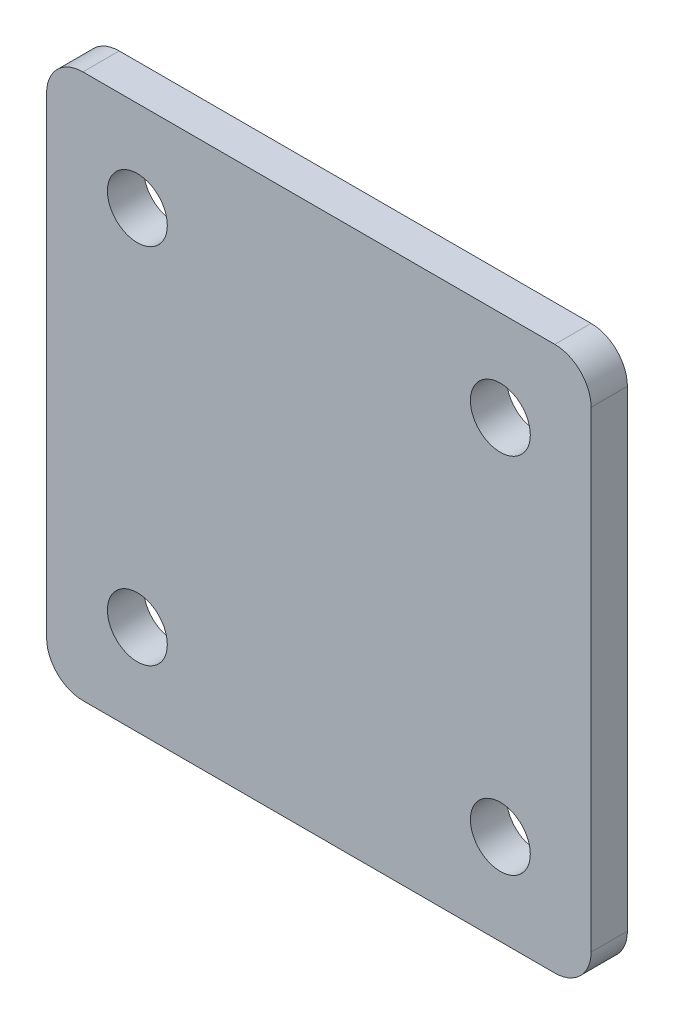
ISO-10303-21;
HEADER;
FILE_DESCRIPTION(('STEP AP214'),'2;1');
FILE_NAME('part.step','',(''),(''),'','','');
FILE_SCHEMA(('AUTOMOTIVE_DESIGN { 1 0 10303 214 1 1 1 1 }'));
ENDSEC;
DATA;
#1=APPLICATION_CONTEXT('core data for automotive mechanical design processes');
#2=APPLICATION_PROTOCOL_DEFINITION('international standard','automotive_design',2000,#1);
#3=PRODUCT_CONTEXT('',#1,'mechanical');
#4=PRODUCT('Part','Part','',(#3));
#5=PRODUCT_RELATED_PRODUCT_CATEGORY('part','',(#4));
#6=PRODUCT_DEFINITION_FORMATION('','',#4);
#7=PRODUCT_DEFINITION_CONTEXT('part definition',#1,'design');
#8=PRODUCT_DEFINITION('design','',#6,#7);
#9=PRODUCT_DEFINITION_SHAPE('','',#8);
#10=(LENGTH_UNIT() NAMED_UNIT(*) SI_UNIT(.MILLI.,.METRE.));
#11=(NAMED_UNIT(*) PLANE_ANGLE_UNIT() SI_UNIT($,.RADIAN.));
#12=(NAMED_UNIT(*) SI_UNIT($,.STERADIAN.) SOLID_ANGLE_UNIT());
#13=UNCERTAINTY_MEASURE_WITH_UNIT(LENGTH_MEASURE(1.E-05),#10,'distance_accuracy_value','');
#14=(GEOMETRIC_REPRESENTATION_CONTEXT(3) GLOBAL_UNCERTAINTY_ASSIGNED_CONTEXT((#13)) GLOBAL_UNIT_ASSIGNED_CONTEXT((#10,
#11,#12)) REPRESENTATION_CONTEXT('',''));
#15=CARTESIAN_POINT('',(0.,0.,0.));
#16=DIRECTION('',(0.,0.,1.));
#17=DIRECTION('',(1.,0.,0.));
#18=AXIS2_PLACEMENT_3D('',#15,#16,#17);
#19=CARTESIAN_POINT('',(15.,15.,2.));
#20=DIRECTION('',(-1.,0.,0.));
#21=DIRECTION('',(0.,-1.,0.));
#22=AXIS2_PLACEMENT_3D('',#19,#20,#21);
#23=PLANE('',#22);
#24=DIRECTION('',(0.,1.,0.));
#25=VECTOR('',#24,1.);
#26=CARTESIAN_POINT('',(15.,15.,2.));
#27=LINE('',#26,#25);
#28=CARTESIAN_POINT('',(15.,-13.,2.));
#29=VERTEX_POINT('',#28);
#30=CARTESIAN_POINT('',(15.,13.,2.));
#31=VERTEX_POINT('',#30);
#32=EDGE_CURVE('E133',#29,#31,#27,.T.);
#33=ORIENTED_EDGE('',*,*,#32,.F.);
#34=DIRECTION('',(0.,0.,-1.));
#35=VECTOR('',#34,1.);
#36=CARTESIAN_POINT('',(15.,-13.,2.));
#37=LINE('',#36,#35);
#38=CARTESIAN_POINT('',(15.,-13.,0.));
#39=VERTEX_POINT('',#38);
#40=EDGE_CURVE('E159',#29,#39,#37,.T.);
#41=ORIENTED_EDGE('',*,*,#40,.T.);
#42=DIRECTION('',(0.,1.,0.));
#43=VECTOR('',#42,1.);
#44=CARTESIAN_POINT('',(15.,15.,0.));
#45=LINE('',#44,#43);
#46=CARTESIAN_POINT('',(15.,13.,0.));
#47=VERTEX_POINT('',#46);
#48=EDGE_CURVE('E165',#39,#47,#45,.T.);
#49=ORIENTED_EDGE('',*,*,#48,.T.);
#50=DIRECTION('',(0.,0.,-1.));
#51=VECTOR('',#50,1.);
#52=CARTESIAN_POINT('',(15.,13.,2.));
#53=LINE('',#52,#51);
#54=EDGE_CURVE('E157',#47,#31,#53,.F.);
#55=ORIENTED_EDGE('',*,*,#54,.T.);
#56=EDGE_LOOP('',(#33,#41,#49,#55));
#57=FACE_BOUND('',#56,.T.);
#58=ADVANCED_FACE('F41',(#57),#23,.F.);
#59=CARTESIAN_POINT('',(-15.,15.,2.));
#60=DIRECTION('',(0.,-1.,0.));
#61=DIRECTION('',(0.,0.,-1.));
#62=AXIS2_PLACEMENT_3D('',#59,#60,#61);
#63=PLANE('',#62);
#64=DIRECTION('',(-1.,0.,0.));
#65=VECTOR('',#64,1.);
#66=CARTESIAN_POINT('',(-15.,15.,2.));
#67=LINE('',#66,#65);
#68=CARTESIAN_POINT('',(13.,15.,2.));
#69=VERTEX_POINT('',#68);
#70=CARTESIAN_POINT('',(-13.,15.,2.));
#71=VERTEX_POINT('',#70);
#72=EDGE_CURVE('E136',#69,#71,#67,.T.);
#73=ORIENTED_EDGE('',*,*,#72,.F.);
#74=DIRECTION('',(0.,0.,-1.));
#75=VECTOR('',#74,1.);
#76=CARTESIAN_POINT('',(13.,15.,2.));
#77=LINE('',#76,#75);
#78=CARTESIAN_POINT('',(13.,15.,0.));
#79=VERTEX_POINT('',#78);
#80=EDGE_CURVE('E11',#69,#79,#77,.T.);
#81=ORIENTED_EDGE('',*,*,#80,.T.);
#82=DIRECTION('',(-1.,0.,0.));
#83=VECTOR('',#82,1.);
#84=CARTESIAN_POINT('',(-15.,15.,0.));
#85=LINE('',#84,#83);
#86=CARTESIAN_POINT('',(-13.,15.,0.));
#87=VERTEX_POINT('',#86);
#88=EDGE_CURVE('E138',#79,#87,#85,.T.);
#89=ORIENTED_EDGE('',*,*,#88,.T.);
#90=DIRECTION('',(0.,0.,-1.));
#91=VECTOR('',#90,1.);
#92=CARTESIAN_POINT('',(-13.,15.,2.));
#93=LINE('',#92,#91);
#94=EDGE_CURVE('E49',#87,#71,#93,.F.);
#95=ORIENTED_EDGE('',*,*,#94,.T.);
#96=EDGE_LOOP('',(#73,#81,#89,#95));
#97=FACE_BOUND('',#96,.T.);
#98=ADVANCED_FACE('F219',(#97),#63,.F.);
#99=CARTESIAN_POINT('',(-15.,15.,2.));
#100=DIRECTION('',(1.,0.,0.));
#101=DIRECTION('',(0.,1.,0.));
#102=AXIS2_PLACEMENT_3D('',#99,#100,#101);
#103=PLANE('',#102);
#104=DIRECTION('',(0.,-1.,0.));
#105=VECTOR('',#104,1.);
#106=CARTESIAN_POINT('',(-15.,15.,0.));
#107=LINE('',#106,#105);
#108=CARTESIAN_POINT('',(-15.,13.,0.));
#109=VERTEX_POINT('',#108);
#110=CARTESIAN_POINT('',(-15.,-13.,0.));
#111=VERTEX_POINT('',#110);
#112=EDGE_CURVE('E134',#109,#111,#107,.T.);
#113=ORIENTED_EDGE('',*,*,#112,.T.);
#114=DIRECTION('',(0.,0.,-1.));
#115=VECTOR('',#114,1.);
#116=CARTESIAN_POINT('',(-15.,-13.,2.));
#117=LINE('',#116,#115);
#118=CARTESIAN_POINT('',(-15.,-13.,2.));
#119=VERTEX_POINT('',#118);
#120=EDGE_CURVE('E112',#111,#119,#117,.F.);
#121=ORIENTED_EDGE('',*,*,#120,.T.);
#122=DIRECTION('',(0.,-1.,0.));
#123=VECTOR('',#122,1.);
#124=CARTESIAN_POINT('',(-15.,15.,2.));
#125=LINE('',#124,#123);
#126=CARTESIAN_POINT('',(-15.,13.,2.));
#127=VERTEX_POINT('',#126);
#128=EDGE_CURVE('E177',#127,#119,#125,.T.);
#129=ORIENTED_EDGE('',*,*,#128,.F.);
#130=DIRECTION('',(0.,0.,-1.));
#131=VECTOR('',#130,1.);
#132=CARTESIAN_POINT('',(-15.,13.,2.));
#133=LINE('',#132,#131);
#134=EDGE_CURVE('E117',#127,#109,#133,.T.);
#135=ORIENTED_EDGE('',*,*,#134,.T.);
#136=EDGE_LOOP('',(#113,#121,#129,#135));
#137=FACE_BOUND('',#136,.T.);
#138=ADVANCED_FACE('F217',(#137),#103,.F.);
#139=CARTESIAN_POINT('',(-15.,-15.,2.));
#140=DIRECTION('',(0.,1.,0.));
#141=DIRECTION('',(0.,0.,1.));
#142=AXIS2_PLACEMENT_3D('',#139,#140,#141);
#143=PLANE('',#142);
#144=DIRECTION('',(1.,0.,0.));
#145=VECTOR('',#144,1.);
#146=CARTESIAN_POINT('',(-15.,-15.,2.));
#147=LINE('',#146,#145);
#148=CARTESIAN_POINT('',(-13.,-15.,2.));
#149=VERTEX_POINT('',#148);
#150=CARTESIAN_POINT('',(13.,-15.,2.));
#151=VERTEX_POINT('',#150);
#152=EDGE_CURVE('E127',#149,#151,#147,.T.);
#153=ORIENTED_EDGE('',*,*,#152,.F.);
#154=DIRECTION('',(0.,0.,-1.));
#155=VECTOR('',#154,1.);
#156=CARTESIAN_POINT('',(-13.,-15.,2.));
#157=LINE('',#156,#155);
#158=CARTESIAN_POINT('',(-13.,-15.,0.));
#159=VERTEX_POINT('',#158);
#160=EDGE_CURVE('E111',#149,#159,#157,.T.);
#161=ORIENTED_EDGE('',*,*,#160,.T.);
#162=DIRECTION('',(1.,0.,0.));
#163=VECTOR('',#162,1.);
#164=CARTESIAN_POINT('',(-15.,-15.,0.));
#165=LINE('',#164,#163);
#166=CARTESIAN_POINT('',(13.,-15.,0.));
#167=VERTEX_POINT('',#166);
#168=EDGE_CURVE('E124',#159,#167,#165,.T.);
#169=ORIENTED_EDGE('',*,*,#168,.T.);
#170=DIRECTION('',(0.,0.,-1.));
#171=VECTOR('',#170,1.);
#172=CARTESIAN_POINT('',(13.,-15.,2.));
#173=LINE('',#172,#171);
#174=EDGE_CURVE('E129',#167,#151,#173,.F.);
#175=ORIENTED_EDGE('',*,*,#174,.T.);
#176=EDGE_LOOP('',(#153,#161,#169,#175));
#177=FACE_BOUND('',#176,.T.);
#178=ADVANCED_FACE('F123',(#177),#143,.F.);
#179=CARTESIAN_POINT('',(0.,0.,2.));
#180=DIRECTION('',(0.,0.,1.));
#181=DIRECTION('',(1.,0.,0.));
#182=AXIS2_PLACEMENT_3D('',#179,#180,#181);
#183=PLANE('',#182);
#184=CARTESIAN_POINT('',(-10.,10.,2.));
#185=DIRECTION('',(0.,0.,1.));
#186=DIRECTION('',(1.,0.,0.));
#187=AXIS2_PLACEMENT_3D('',#184,#185,#186);
#188=CIRCLE('',#187,1.65);
#189=CARTESIAN_POINT('',(-8.35,10.,2.));
#190=VERTEX_POINT('',#189);
#191=EDGE_CURVE('E198',#190,#190,#188,.T.);
#192=ORIENTED_EDGE('',*,*,#191,.F.);
#193=EDGE_LOOP('',(#192));
#194=FACE_BOUND('',#193,.T.);
#195=CARTESIAN_POINT('',(10.,10.,2.));
#196=DIRECTION('',(0.,0.,1.));
#197=DIRECTION('',(1.,0.,0.));
#198=AXIS2_PLACEMENT_3D('',#195,#196,#197);
#199=CIRCLE('',#198,1.65);
#200=CARTESIAN_POINT('',(11.65,10.,2.));
#201=VERTEX_POINT('',#200);
#202=EDGE_CURVE('E192',#201,#201,#199,.T.);
#203=ORIENTED_EDGE('',*,*,#202,.F.);
#204=EDGE_LOOP('',(#203));
#205=FACE_BOUND('',#204,.T.);
#206=CARTESIAN_POINT('',(-10.,-10.,2.));
#207=DIRECTION('',(0.,0.,1.));
#208=DIRECTION('',(1.,0.,0.));
#209=AXIS2_PLACEMENT_3D('',#206,#207,#208);
#210=CIRCLE('',#209,1.65);
#211=CARTESIAN_POINT('',(-8.35,-10.,2.));
#212=VERTEX_POINT('',#211);
#213=EDGE_CURVE('E186',#212,#212,#210,.T.);
#214=ORIENTED_EDGE('',*,*,#213,.F.);
#215=EDGE_LOOP('',(#214));
#216=FACE_BOUND('',#215,.T.);
#217=CARTESIAN_POINT('',(10.,-10.,2.));
#218=DIRECTION('',(0.,0.,1.));
#219=DIRECTION('',(1.,0.,0.));
#220=AXIS2_PLACEMENT_3D('',#217,#218,#219);
#221=CIRCLE('',#220,1.65);
#222=CARTESIAN_POINT('',(11.65,-10.,2.));
#223=VERTEX_POINT('',#222);
#224=EDGE_CURVE('E173',#223,#223,#221,.T.);
#225=ORIENTED_EDGE('',*,*,#224,.F.);
#226=EDGE_LOOP('',(#225));
#227=FACE_BOUND('',#226,.T.);
#228=ORIENTED_EDGE('',*,*,#128,.T.);
#229=CARTESIAN_POINT('',(-13.,-13.,2.));
#230=DIRECTION('',(0.,0.,1.));
#231=DIRECTION('',(1.,0.,0.));
#232=AXIS2_PLACEMENT_3D('',#229,#230,#231);
#233=CIRCLE('',#232,2.);
#234=EDGE_CURVE('E155',#119,#149,#233,.T.);
#235=ORIENTED_EDGE('',*,*,#234,.T.);
#236=ORIENTED_EDGE('',*,*,#152,.T.);
#237=CARTESIAN_POINT('',(13.,-13.,2.));
#238=DIRECTION('',(0.,0.,1.));
#239=DIRECTION('',(1.,0.,0.));
#240=AXIS2_PLACEMENT_3D('',#237,#238,#239);
#241=CIRCLE('',#240,2.);
#242=EDGE_CURVE('E153',#151,#29,#241,.T.);
#243=ORIENTED_EDGE('',*,*,#242,.T.);
#244=ORIENTED_EDGE('',*,*,#32,.T.);
#245=CARTESIAN_POINT('',(13.,13.,2.));
#246=DIRECTION('',(0.,0.,1.));
#247=DIRECTION('',(1.,0.,0.));
#248=AXIS2_PLACEMENT_3D('',#245,#246,#247);
#249=CIRCLE('',#248,2.);
#250=EDGE_CURVE('E62',#31,#69,#249,.T.);
#251=ORIENTED_EDGE('',*,*,#250,.T.);
#252=ORIENTED_EDGE('',*,*,#72,.T.);
#253=CARTESIAN_POINT('',(-13.,13.,2.));
#254=DIRECTION('',(0.,0.,1.));
#255=DIRECTION('',(1.,0.,0.));
#256=AXIS2_PLACEMENT_3D('',#253,#254,#255);
#257=CIRCLE('',#256,2.);
#258=EDGE_CURVE('E150',#71,#127,#257,.T.);
#259=ORIENTED_EDGE('',*,*,#258,.T.);
#260=EDGE_LOOP('',(#228,#235,#236,#243,#244,#251,#252,#259));
#261=FACE_BOUND('',#260,.T.);
#262=ADVANCED_FACE('F204',(#194,#205,#216,#227,#261),#183,.T.);
#263=CARTESIAN_POINT('',(0.,0.,0.));
#264=DIRECTION('',(0.,0.,1.));
#265=DIRECTION('',(1.,0.,0.));
#266=AXIS2_PLACEMENT_3D('',#263,#264,#265);
#267=PLANE('',#266);
#268=CARTESIAN_POINT('',(-10.,10.,0.));
#269=DIRECTION('',(0.,0.,1.));
#270=DIRECTION('',(1.,0.,0.));
#271=AXIS2_PLACEMENT_3D('',#268,#269,#270);
#272=CIRCLE('',#271,1.65);
#273=CARTESIAN_POINT('',(-8.35,10.,0.));
#274=VERTEX_POINT('',#273);
#275=EDGE_CURVE('E195',#274,#274,#272,.T.);
#276=ORIENTED_EDGE('',*,*,#275,.T.);
#277=EDGE_LOOP('',(#276));
#278=FACE_BOUND('',#277,.T.);
#279=CARTESIAN_POINT('',(10.,10.,0.));
#280=DIRECTION('',(0.,0.,1.));
#281=DIRECTION('',(1.,0.,0.));
#282=AXIS2_PLACEMENT_3D('',#279,#280,#281);
#283=CIRCLE('',#282,1.65);
#284=CARTESIAN_POINT('',(11.65,10.,0.));
#285=VERTEX_POINT('',#284);
#286=EDGE_CURVE('E189',#285,#285,#283,.T.);
#287=ORIENTED_EDGE('',*,*,#286,.T.);
#288=EDGE_LOOP('',(#287));
#289=FACE_BOUND('',#288,.T.);
#290=CARTESIAN_POINT('',(-10.,-10.,0.));
#291=DIRECTION('',(0.,0.,1.));
#292=DIRECTION('',(1.,0.,0.));
#293=AXIS2_PLACEMENT_3D('',#290,#291,#292);
#294=CIRCLE('',#293,1.65);
#295=CARTESIAN_POINT('',(-8.35,-10.,0.));
#296=VERTEX_POINT('',#295);
#297=EDGE_CURVE('E183',#296,#296,#294,.T.);
#298=ORIENTED_EDGE('',*,*,#297,.T.);
#299=EDGE_LOOP('',(#298));
#300=FACE_BOUND('',#299,.T.);
#301=CARTESIAN_POINT('',(10.,-10.,0.));
#302=DIRECTION('',(0.,0.,1.));
#303=DIRECTION('',(1.,0.,0.));
#304=AXIS2_PLACEMENT_3D('',#301,#302,#303);
#305=CIRCLE('',#304,1.65);
#306=CARTESIAN_POINT('',(11.65,-10.,0.));
#307=VERTEX_POINT('',#306);
#308=EDGE_CURVE('E170',#307,#307,#305,.T.);
#309=ORIENTED_EDGE('',*,*,#308,.T.);
#310=EDGE_LOOP('',(#309));
#311=FACE_BOUND('',#310,.T.);
#312=ORIENTED_EDGE('',*,*,#168,.F.);
#313=CARTESIAN_POINT('',(-13.,-13.,0.));
#314=DIRECTION('',(0.,0.,1.));
#315=DIRECTION('',(1.,0.,0.));
#316=AXIS2_PLACEMENT_3D('',#313,#314,#315);
#317=CIRCLE('',#316,2.);
#318=EDGE_CURVE('E107',#159,#111,#317,.F.);
#319=ORIENTED_EDGE('',*,*,#318,.T.);
#320=ORIENTED_EDGE('',*,*,#112,.F.);
#321=CARTESIAN_POINT('',(-13.,13.,0.));
#322=DIRECTION('',(0.,0.,1.));
#323=DIRECTION('',(1.,0.,0.));
#324=AXIS2_PLACEMENT_3D('',#321,#322,#323);
#325=CIRCLE('',#324,2.);
#326=EDGE_CURVE('E128',#109,#87,#325,.F.);
#327=ORIENTED_EDGE('',*,*,#326,.T.);
#328=ORIENTED_EDGE('',*,*,#88,.F.);
#329=CARTESIAN_POINT('',(13.,13.,0.));
#330=DIRECTION('',(0.,0.,1.));
#331=DIRECTION('',(1.,0.,0.));
#332=AXIS2_PLACEMENT_3D('',#329,#330,#331);
#333=CIRCLE('',#332,2.);
#334=EDGE_CURVE('E144',#79,#47,#333,.F.);
#335=ORIENTED_EDGE('',*,*,#334,.T.);
#336=ORIENTED_EDGE('',*,*,#48,.F.);
#337=CARTESIAN_POINT('',(13.,-13.,0.));
#338=DIRECTION('',(0.,0.,1.));
#339=DIRECTION('',(1.,0.,0.));
#340=AXIS2_PLACEMENT_3D('',#337,#338,#339);
#341=CIRCLE('',#340,2.);
#342=EDGE_CURVE('E118',#39,#167,#341,.F.);
#343=ORIENTED_EDGE('',*,*,#342,.T.);
#344=EDGE_LOOP('',(#312,#319,#320,#327,#328,#335,#336,#343));
#345=FACE_BOUND('',#344,.T.);
#346=ADVANCED_FACE('F131',(#278,#289,#300,#311,#345),#267,.F.);
#347=CARTESIAN_POINT('',(10.,-10.,2.));
#348=DIRECTION('',(0.,0.,1.));
#349=DIRECTION('',(1.,0.,0.));
#350=AXIS2_PLACEMENT_3D('',#347,#348,#349);
#351=CYLINDRICAL_SURFACE('',#350,1.65);
#352=ORIENTED_EDGE('',*,*,#308,.F.);
#353=EDGE_LOOP('',(#352));
#354=FACE_BOUND('',#353,.T.);
#355=ORIENTED_EDGE('',*,*,#224,.T.);
#356=EDGE_LOOP('',(#355));
#357=FACE_BOUND('',#356,.T.);
#358=ADVANCED_FACE('F243',(#354,#357),#351,.F.);
#359=CARTESIAN_POINT('',(-10.,-10.,2.));
#360=DIRECTION('',(0.,0.,1.));
#361=DIRECTION('',(1.,0.,0.));
#362=AXIS2_PLACEMENT_3D('',#359,#360,#361);
#363=CYLINDRICAL_SURFACE('',#362,1.65);
#364=ORIENTED_EDGE('',*,*,#297,.F.);
#365=EDGE_LOOP('',(#364));
#366=FACE_BOUND('',#365,.T.);
#367=ORIENTED_EDGE('',*,*,#213,.T.);
#368=EDGE_LOOP('',(#367));
#369=FACE_BOUND('',#368,.T.);
#370=ADVANCED_FACE('F248',(#366,#369),#363,.F.);
#371=CARTESIAN_POINT('',(10.,10.,2.));
#372=DIRECTION('',(0.,0.,1.));
#373=DIRECTION('',(1.,0.,0.));
#374=AXIS2_PLACEMENT_3D('',#371,#372,#373);
#375=CYLINDRICAL_SURFACE('',#374,1.65);
#376=ORIENTED_EDGE('',*,*,#286,.F.);
#377=EDGE_LOOP('',(#376));
#378=FACE_BOUND('',#377,.T.);
#379=ORIENTED_EDGE('',*,*,#202,.T.);
#380=EDGE_LOOP('',(#379));
#381=FACE_BOUND('',#380,.T.);
#382=ADVANCED_FACE('F252',(#378,#381),#375,.F.);
#383=CARTESIAN_POINT('',(-10.,10.,2.));
#384=DIRECTION('',(0.,0.,1.));
#385=DIRECTION('',(1.,0.,0.));
#386=AXIS2_PLACEMENT_3D('',#383,#384,#385);
#387=CYLINDRICAL_SURFACE('',#386,1.65);
#388=ORIENTED_EDGE('',*,*,#275,.F.);
#389=EDGE_LOOP('',(#388));
#390=FACE_BOUND('',#389,.T.);
#391=ORIENTED_EDGE('',*,*,#191,.T.);
#392=EDGE_LOOP('',(#391));
#393=FACE_BOUND('',#392,.T.);
#394=ADVANCED_FACE('F202',(#390,#393),#387,.F.);
#395=CARTESIAN_POINT('',(-13.,-13.,2.));
#396=DIRECTION('',(0.,0.,-1.));
#397=DIRECTION('',(-1.,0.,0.));
#398=AXIS2_PLACEMENT_3D('',#395,#396,#397);
#399=CYLINDRICAL_SURFACE('',#398,2.);
#400=ORIENTED_EDGE('',*,*,#234,.F.);
#401=ORIENTED_EDGE('',*,*,#120,.F.);
#402=ORIENTED_EDGE('',*,*,#318,.F.);
#403=ORIENTED_EDGE('',*,*,#160,.F.);
#404=EDGE_LOOP('',(#400,#401,#402,#403));
#405=FACE_BOUND('',#404,.T.);
#406=ADVANCED_FACE('F110',(#405),#399,.T.);
#407=CARTESIAN_POINT('',(13.,-13.,2.));
#408=DIRECTION('',(0.,0.,-1.));
#409=DIRECTION('',(-1.,0.,0.));
#410=AXIS2_PLACEMENT_3D('',#407,#408,#409);
#411=CYLINDRICAL_SURFACE('',#410,2.);
#412=ORIENTED_EDGE('',*,*,#242,.F.);
#413=ORIENTED_EDGE('',*,*,#174,.F.);
#414=ORIENTED_EDGE('',*,*,#342,.F.);
#415=ORIENTED_EDGE('',*,*,#40,.F.);
#416=EDGE_LOOP('',(#412,#413,#414,#415));
#417=FACE_BOUND('',#416,.T.);
#418=ADVANCED_FACE('F223',(#417),#411,.T.);
#419=CARTESIAN_POINT('',(13.,13.,2.));
#420=DIRECTION('',(0.,0.,-1.));
#421=DIRECTION('',(-1.,0.,0.));
#422=AXIS2_PLACEMENT_3D('',#419,#420,#421);
#423=CYLINDRICAL_SURFACE('',#422,2.);
#424=ORIENTED_EDGE('',*,*,#250,.F.);
#425=ORIENTED_EDGE('',*,*,#54,.F.);
#426=ORIENTED_EDGE('',*,*,#334,.F.);
#427=ORIENTED_EDGE('',*,*,#80,.F.);
#428=EDGE_LOOP('',(#424,#425,#426,#427));
#429=FACE_BOUND('',#428,.T.);
#430=ADVANCED_FACE('F222',(#429),#423,.T.);
#431=CARTESIAN_POINT('',(-13.,13.,2.));
#432=DIRECTION('',(0.,0.,-1.));
#433=DIRECTION('',(-1.,0.,0.));
#434=AXIS2_PLACEMENT_3D('',#431,#432,#433);
#435=CYLINDRICAL_SURFACE('',#434,2.);
#436=ORIENTED_EDGE('',*,*,#258,.F.);
#437=ORIENTED_EDGE('',*,*,#94,.F.);
#438=ORIENTED_EDGE('',*,*,#326,.F.);
#439=ORIENTED_EDGE('',*,*,#134,.F.);
#440=EDGE_LOOP('',(#436,#437,#438,#439));
#441=FACE_BOUND('',#440,.T.);
#442=ADVANCED_FACE('F43',(#441),#435,.T.);
#443=CLOSED_SHELL('',(#58,#98,#138,#178,#262,#346,#358,#370,#382,#394,#406,#418,#430,#442));
#444=MANIFOLD_SOLID_BREP('B2',#443);
#445=ADVANCED_BREP_SHAPE_REPRESENTATION('',(#18,#444),#14);
#446=SHAPE_DEFINITION_REPRESENTATION(#9,#445);
ENDSEC;
END-ISO-10303-21;
